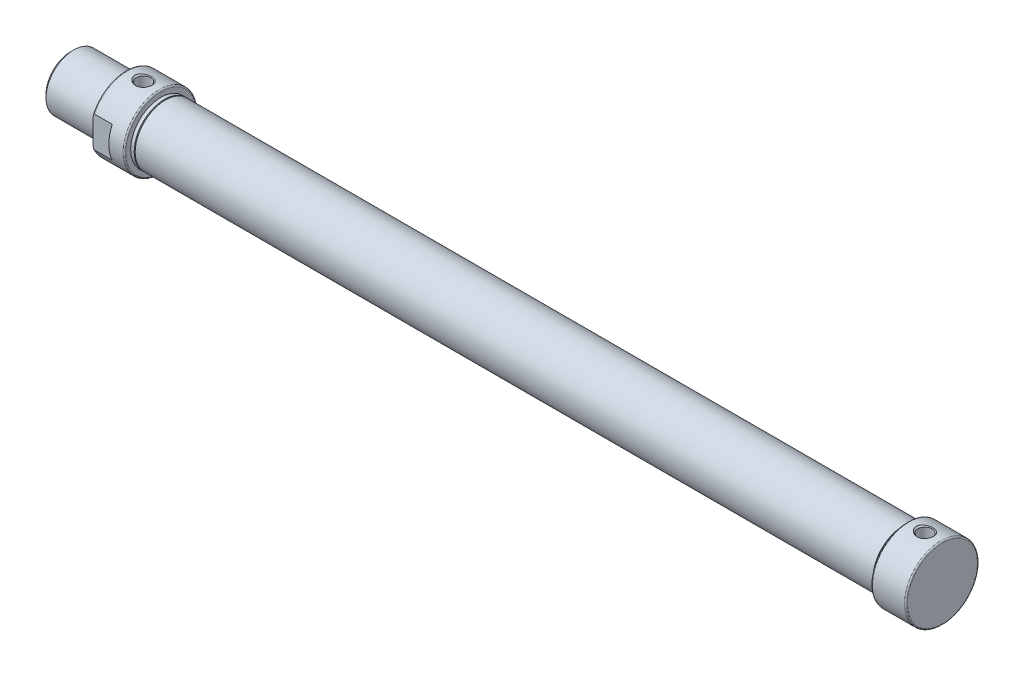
ISO-10303-21;
HEADER;
FILE_DESCRIPTION(('STEP AP214'),'2;1');
FILE_NAME('part.step','',(''),(''),'','','');
FILE_SCHEMA(('AUTOMOTIVE_DESIGN { 1 0 10303 214 1 1 1 1 }'));
ENDSEC;
DATA;
#1=APPLICATION_CONTEXT('core data for automotive mechanical design processes');
#2=APPLICATION_PROTOCOL_DEFINITION('international standard','automotive_design',2000,#1);
#3=PRODUCT_CONTEXT('',#1,'mechanical');
#4=PRODUCT('Part','Part','',(#3));
#5=PRODUCT_RELATED_PRODUCT_CATEGORY('part','',(#4));
#6=PRODUCT_DEFINITION_FORMATION('','',#4);
#7=PRODUCT_DEFINITION_CONTEXT('part definition',#1,'design');
#8=PRODUCT_DEFINITION('design','',#6,#7);
#9=PRODUCT_DEFINITION_SHAPE('','',#8);
#10=(LENGTH_UNIT() NAMED_UNIT(*) SI_UNIT(.MILLI.,.METRE.));
#11=(NAMED_UNIT(*) PLANE_ANGLE_UNIT() SI_UNIT($,.RADIAN.));
#12=(NAMED_UNIT(*) SI_UNIT($,.STERADIAN.) SOLID_ANGLE_UNIT());
#13=UNCERTAINTY_MEASURE_WITH_UNIT(LENGTH_MEASURE(1.E-05),#10,'distance_accuracy_value','');
#14=(GEOMETRIC_REPRESENTATION_CONTEXT(3) GLOBAL_UNCERTAINTY_ASSIGNED_CONTEXT((#13)) GLOBAL_UNIT_ASSIGNED_CONTEXT((#10,
#11,#12)) REPRESENTATION_CONTEXT('',''));
#15=CARTESIAN_POINT('',(0.,0.,0.));
#16=DIRECTION('',(0.,0.,1.));
#17=DIRECTION('',(1.,0.,0.));
#18=AXIS2_PLACEMENT_3D('',#15,#16,#17);
#19=CARTESIAN_POINT('',(231.,8.,0.));
#20=DIRECTION('',(-1.,0.,0.));
#21=DIRECTION('',(0.,0.,1.));
#22=AXIS2_PLACEMENT_3D('',#19,#20,#21);
#23=PLANE('',#22);
#24=CARTESIAN_POINT('',(231.,0.,0.));
#25=DIRECTION('',(-1.,0.,0.));
#26=DIRECTION('',(0.,0.,1.));
#27=AXIS2_PLACEMENT_3D('',#24,#25,#26);
#28=CIRCLE('',#27,8.);
#29=CARTESIAN_POINT('',(231.,0.,8.));
#30=VERTEX_POINT('',#29);
#31=EDGE_CURVE('E741',#30,#30,#28,.T.);
#32=ORIENTED_EDGE('',*,*,#31,.T.);
#33=EDGE_LOOP('',(#32));
#34=FACE_BOUND('',#33,.T.);
#35=ADVANCED_FACE('F17',(#34),#23,.T.);
#36=CARTESIAN_POINT('',(231.,0.,0.));
#37=DIRECTION('',(-1.,0.,0.));
#38=DIRECTION('',(0.,0.,1.));
#39=AXIS2_PLACEMENT_3D('',#36,#37,#38);
#40=CYLINDRICAL_SURFACE('',#39,8.);
#41=CARTESIAN_POINT('',(36.,0.,0.));
#42=DIRECTION('',(-1.,0.,0.));
#43=DIRECTION('',(0.,0.,1.));
#44=AXIS2_PLACEMENT_3D('',#41,#42,#43);
#45=CIRCLE('',#44,8.);
#46=CARTESIAN_POINT('',(36.,0.,8.));
#47=VERTEX_POINT('',#46);
#48=EDGE_CURVE('E743',#47,#47,#45,.F.);
#49=ORIENTED_EDGE('',*,*,#48,.F.);
#50=EDGE_LOOP('',(#49));
#51=FACE_BOUND('',#50,.T.);
#52=ORIENTED_EDGE('',*,*,#31,.F.);
#53=EDGE_LOOP('',(#52));
#54=FACE_BOUND('',#53,.T.);
#55=ADVANCED_FACE('F716',(#51,#54),#40,.F.);
#56=CARTESIAN_POINT('',(36.,3.,0.));
#57=DIRECTION('',(1.,0.,0.));
#58=DIRECTION('',(0.,0.,-1.));
#59=AXIS2_PLACEMENT_3D('',#56,#57,#58);
#60=PLANE('',#59);
#61=ORIENTED_EDGE('',*,*,#48,.T.);
#62=EDGE_LOOP('',(#61));
#63=FACE_BOUND('',#62,.T.);
#64=CARTESIAN_POINT('',(36.,0.,0.));
#65=DIRECTION('',(-1.,0.,0.));
#66=DIRECTION('',(0.,0.,1.));
#67=AXIS2_PLACEMENT_3D('',#64,#65,#66);
#68=CIRCLE('',#67,3.);
#69=CARTESIAN_POINT('',(36.,0.,3.));
#70=VERTEX_POINT('',#69);
#71=EDGE_CURVE('E746',#70,#70,#68,.T.);
#72=ORIENTED_EDGE('',*,*,#71,.T.);
#73=EDGE_LOOP('',(#72));
#74=FACE_BOUND('',#73,.T.);
#75=ADVANCED_FACE('F706',(#63,#74),#60,.T.);
#76=CARTESIAN_POINT('',(231.,0.,0.));
#77=DIRECTION('',(-1.,0.,0.));
#78=DIRECTION('',(0.,0.,1.));
#79=AXIS2_PLACEMENT_3D('',#76,#77,#78);
#80=CYLINDRICAL_SURFACE('',#79,3.);
#81=ORIENTED_EDGE('',*,*,#71,.F.);
#82=EDGE_LOOP('',(#81));
#83=FACE_BOUND('',#82,.T.);
#84=CARTESIAN_POINT('',(0.,0.,0.));
#85=DIRECTION('',(-1.,0.,0.));
#86=DIRECTION('',(0.,0.,1.));
#87=AXIS2_PLACEMENT_3D('',#84,#85,#86);
#88=CIRCLE('',#87,3.);
#89=CARTESIAN_POINT('',(0.,0.,3.));
#90=VERTEX_POINT('',#89);
#91=EDGE_CURVE('E784',#90,#90,#88,.T.);
#92=ORIENTED_EDGE('',*,*,#91,.T.);
#93=EDGE_LOOP('',(#92));
#94=FACE_BOUND('',#93,.T.);
#95=ADVANCED_FACE('F696',(#83,#94),#80,.F.);
#96=CARTESIAN_POINT('',(0.,0.,0.));
#97=DIRECTION('',(1.,0.,0.));
#98=DIRECTION('',(0.,0.,-1.));
#99=AXIS2_PLACEMENT_3D('',#96,#97,#98);
#100=PLANE('',#99);
#101=ORIENTED_EDGE('',*,*,#91,.F.);
#102=EDGE_LOOP('',(#101));
#103=FACE_BOUND('',#102,.T.);
#104=CARTESIAN_POINT('',(0.,0.,0.));
#105=DIRECTION('',(1.,0.,0.));
#106=DIRECTION('',(0.,0.,-1.));
#107=AXIS2_PLACEMENT_3D('',#104,#105,#106);
#108=CIRCLE('',#107,7.08);
#109=CARTESIAN_POINT('',(0.,0.,-7.08));
#110=VERTEX_POINT('',#109);
#111=EDGE_CURVE('E244',#110,#110,#108,.T.);
#112=ORIENTED_EDGE('',*,*,#111,.F.);
#113=EDGE_LOOP('',(#112));
#114=FACE_BOUND('',#113,.T.);
#115=ADVANCED_FACE('F686',(#103,#114),#100,.F.);
#116=CARTESIAN_POINT('',(0.919999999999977,0.,0.));
#117=DIRECTION('',(1.,0.,0.));
#118=DIRECTION('',(0.,0.,-1.));
#119=AXIS2_PLACEMENT_3D('',#116,#117,#118);
#120=CONICAL_SURFACE('',#119,8.,0.785398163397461);
#121=CARTESIAN_POINT('',(0.919999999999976,0.,0.));
#122=DIRECTION('',(-1.,0.,0.));
#123=DIRECTION('',(0.,0.,1.));
#124=AXIS2_PLACEMENT_3D('',#121,#122,#123);
#125=CIRCLE('',#124,8.);
#126=CARTESIAN_POINT('',(0.919999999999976,0.,8.));
#127=VERTEX_POINT('',#126);
#128=EDGE_CURVE('E240',#127,#127,#125,.F.);
#129=ORIENTED_EDGE('',*,*,#128,.F.);
#130=EDGE_LOOP('',(#129));
#131=FACE_BOUND('',#130,.T.);
#132=ORIENTED_EDGE('',*,*,#111,.T.);
#133=EDGE_LOOP('',(#132));
#134=FACE_BOUND('',#133,.T.);
#135=ADVANCED_FACE('F676',(#131,#134),#120,.T.);
#136=CARTESIAN_POINT('',(248.067,3.75,0.));
#137=DIRECTION('',(0.,1.,0.));
#138=DIRECTION('',(0.,0.,1.));
#139=AXIS2_PLACEMENT_3D('',#136,#137,#138);
#140=PLANE('',#139);
#141=CARTESIAN_POINT('',(246.,3.75,0.));
#142=DIRECTION('',(0.,1.,0.));
#143=DIRECTION('',(0.,0.,1.));
#144=AXIS2_PLACEMENT_3D('',#141,#142,#143);
#145=CIRCLE('',#144,2.06700000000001);
#146=CARTESIAN_POINT('',(246.,3.75,2.06700000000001));
#147=VERTEX_POINT('',#146);
#148=EDGE_CURVE('E243',#147,#147,#145,.T.);
#149=ORIENTED_EDGE('',*,*,#148,.T.);
#150=EDGE_LOOP('',(#149));
#151=FACE_BOUND('',#150,.T.);
#152=ADVANCED_FACE('F666',(#151),#140,.T.);
#153=CARTESIAN_POINT('',(23.067,3.75,0.));
#154=DIRECTION('',(0.,1.,0.));
#155=DIRECTION('',(0.,0.,1.));
#156=AXIS2_PLACEMENT_3D('',#153,#154,#155);
#157=PLANE('',#156);
#158=CARTESIAN_POINT('',(21.,3.75,0.));
#159=DIRECTION('',(0.,1.,0.));
#160=DIRECTION('',(0.,0.,1.));
#161=AXIS2_PLACEMENT_3D('',#158,#159,#160);
#162=CIRCLE('',#161,2.067);
#163=CARTESIAN_POINT('',(21.,3.75,2.067));
#164=VERTEX_POINT('',#163);
#165=EDGE_CURVE('E768',#164,#164,#162,.T.);
#166=ORIENTED_EDGE('',*,*,#165,.T.);
#167=EDGE_LOOP('',(#166));
#168=FACE_BOUND('',#167,.T.);
#169=ADVANCED_FACE('F657',(#168),#157,.T.);
#170=CARTESIAN_POINT('',(251.,0.,0.));
#171=DIRECTION('',(-1.,0.,0.));
#172=DIRECTION('',(0.,0.,1.));
#173=AXIS2_PLACEMENT_3D('',#170,#171,#172);
#174=CYLINDRICAL_SURFACE('',#173,8.);
#175=ORIENTED_EDGE('',*,*,#128,.T.);
#176=EDGE_LOOP('',(#175));
#177=FACE_BOUND('',#176,.T.);
#178=CARTESIAN_POINT('',(16.,0.,0.));
#179=DIRECTION('',(-1.,0.,0.));
#180=DIRECTION('',(0.,0.,1.));
#181=AXIS2_PLACEMENT_3D('',#178,#179,#180);
#182=CIRCLE('',#181,8.);
#183=CARTESIAN_POINT('',(16.,0.,8.));
#184=VERTEX_POINT('',#183);
#185=EDGE_CURVE('E766',#184,#184,#182,.T.);
#186=ORIENTED_EDGE('',*,*,#185,.T.);
#187=EDGE_LOOP('',(#186));
#188=FACE_BOUND('',#187,.T.);
#189=ADVANCED_FACE('F649',(#177,#188),#174,.T.);
#190=CARTESIAN_POINT('',(246.,3.75,0.));
#191=DIRECTION('',(0.,1.,0.));
#192=DIRECTION('',(0.,0.,1.));
#193=AXIS2_PLACEMENT_3D('',#190,#191,#192);
#194=CYLINDRICAL_SURFACE('',#193,2.06700000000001);
#195=CARTESIAN_POINT('',(246.,10.0669999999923,0.));
#196=DIRECTION('',(0.,1.,0.));
#197=DIRECTION('',(0.,0.,1.));
#198=AXIS2_PLACEMENT_3D('',#195,#196,#197);
#199=CIRCLE('',#198,2.06700000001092);
#200=CARTESIAN_POINT('',(246.,10.0669999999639,-2.06699999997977));
#201=VERTEX_POINT('',#200);
#202=CARTESIAN_POINT('',(246.,10.0669999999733,2.06699999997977));
#203=VERTEX_POINT('',#202);
#204=EDGE_CURVE('E234',#201,#203,#199,.T.);
#205=ORIENTED_EDGE('',*,*,#204,.T.);
#206=CARTESIAN_POINT('',(246.,10.0669999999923,0.));
#207=DIRECTION('',(0.,1.,0.));
#208=DIRECTION('',(0.,0.,1.));
#209=AXIS2_PLACEMENT_3D('',#206,#207,#208);
#210=CIRCLE('',#209,2.06700000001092);
#211=EDGE_CURVE('E224',#203,#201,#210,.T.);
#212=ORIENTED_EDGE('',*,*,#211,.T.);
#213=EDGE_LOOP('',(#205,#212));
#214=FACE_BOUND('',#213,.T.);
#215=ORIENTED_EDGE('',*,*,#148,.F.);
#216=EDGE_LOOP('',(#215));
#217=FACE_BOUND('',#216,.T.);
#218=ADVANCED_FACE('F206',(#214,#217),#194,.F.);
#219=CARTESIAN_POINT('',(251.,10.1,0.));
#220=DIRECTION('',(-1.,0.,0.));
#221=DIRECTION('',(0.,0.,1.));
#222=AXIS2_PLACEMENT_3D('',#219,#220,#221);
#223=PLANE('',#222);
#224=CARTESIAN_POINT('',(251.,0.,0.));
#225=DIRECTION('',(-1.,0.,0.));
#226=DIRECTION('',(0.,0.,-1.));
#227=AXIS2_PLACEMENT_3D('',#224,#225,#226);
#228=CIRCLE('',#227,10.1);
#229=CARTESIAN_POINT('',(251.,0.,-10.1));
#230=VERTEX_POINT('',#229);
#231=CARTESIAN_POINT('',(251.,0.,10.1));
#232=VERTEX_POINT('',#231);
#233=EDGE_CURVE('E188',#230,#232,#228,.T.);
#234=ORIENTED_EDGE('',*,*,#233,.F.);
#235=CARTESIAN_POINT('',(251.,0.,0.));
#236=DIRECTION('',(-1.,0.,0.));
#237=DIRECTION('',(0.,0.,1.));
#238=AXIS2_PLACEMENT_3D('',#235,#236,#237);
#239=CIRCLE('',#238,10.1);
#240=EDGE_CURVE('E220',#232,#230,#239,.T.);
#241=ORIENTED_EDGE('',*,*,#240,.F.);
#242=EDGE_LOOP('',(#234,#241));
#243=FACE_BOUND('',#242,.T.);
#244=ADVANCED_FACE('F195',(#243),#223,.F.);
#245=CARTESIAN_POINT('',(21.,3.75,0.));
#246=DIRECTION('',(0.,1.,0.));
#247=DIRECTION('',(0.,0.,1.));
#248=AXIS2_PLACEMENT_3D('',#245,#246,#247);
#249=CYLINDRICAL_SURFACE('',#248,2.067);
#250=CARTESIAN_POINT('',(21.,10.0670000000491,0.));
#251=DIRECTION('',(0.,1.,0.));
#252=DIRECTION('',(0.,0.,1.));
#253=AXIS2_PLACEMENT_3D('',#250,#251,#252);
#254=CIRCLE('',#253,2.06700000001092);
#255=CARTESIAN_POINT('',(21.,10.0670000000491,2.06700000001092));
#256=VERTEX_POINT('',#255);
#257=EDGE_CURVE('E136',#256,#256,#254,.T.);
#258=ORIENTED_EDGE('',*,*,#257,.T.);
#259=EDGE_LOOP('',(#258));
#260=FACE_BOUND('',#259,.T.);
#261=ORIENTED_EDGE('',*,*,#165,.F.);
#262=EDGE_LOOP('',(#261));
#263=FACE_BOUND('',#262,.T.);
#264=ADVANCED_FACE('F205',(#260,#263),#249,.F.);
#265=CARTESIAN_POINT('',(16.,8.,0.));
#266=DIRECTION('',(1.,0.,0.));
#267=DIRECTION('',(0.,0.,-1.));
#268=AXIS2_PLACEMENT_3D('',#265,#266,#267);
#269=PLANE('',#268);
#270=DIRECTION('',(0.,1.,0.));
#271=VECTOR('',#270,1.);
#272=CARTESIAN_POINT('',(16.,10.5,9.5));
#273=LINE('',#272,#271);
#274=CARTESIAN_POINT('',(16.,-3.42928563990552,9.5));
#275=VERTEX_POINT('',#274);
#276=CARTESIAN_POINT('',(16.,3.4292856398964,9.5));
#277=VERTEX_POINT('',#276);
#278=EDGE_CURVE('E331',#275,#277,#273,.T.);
#279=ORIENTED_EDGE('',*,*,#278,.T.);
#280=CARTESIAN_POINT('',(16.,0.,0.));
#281=DIRECTION('',(1.,0.,0.));
#282=DIRECTION('',(0.,0.339533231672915,-0.940594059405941));
#283=AXIS2_PLACEMENT_3D('',#280,#281,#282);
#284=CIRCLE('',#283,10.1);
#285=CARTESIAN_POINT('',(16.,3.42928563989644,-9.5));
#286=VERTEX_POINT('',#285);
#287=EDGE_CURVE('E112',#286,#277,#284,.T.);
#288=ORIENTED_EDGE('',*,*,#287,.F.);
#289=DIRECTION('',(0.,1.,0.));
#290=VECTOR('',#289,1.);
#291=CARTESIAN_POINT('',(16.,-10.5,-9.5));
#292=LINE('',#291,#290);
#293=CARTESIAN_POINT('',(16.,-3.42928563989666,-9.50000000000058));
#294=VERTEX_POINT('',#293);
#295=EDGE_CURVE('E108',#286,#294,#292,.F.);
#296=ORIENTED_EDGE('',*,*,#295,.T.);
#297=CARTESIAN_POINT('',(16.,0.,0.));
#298=DIRECTION('',(1.,0.,0.));
#299=DIRECTION('',(0.,-0.339533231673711,0.940594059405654));
#300=AXIS2_PLACEMENT_3D('',#297,#298,#299);
#301=CIRCLE('',#300,10.1000000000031);
#302=EDGE_CURVE('E327',#275,#294,#301,.T.);
#303=ORIENTED_EDGE('',*,*,#302,.F.);
#304=EDGE_LOOP('',(#279,#288,#296,#303));
#305=FACE_BOUND('',#304,.T.);
#306=ORIENTED_EDGE('',*,*,#185,.F.);
#307=EDGE_LOOP('',(#306));
#308=FACE_BOUND('',#307,.T.);
#309=ADVANCED_FACE('F305',(#305,#308),#269,.F.);
#310=CARTESIAN_POINT('',(246.,10.5027149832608,0.));
#311=DIRECTION('',(0.,1.,0.));
#312=DIRECTION('',(0.,0.,1.));
#313=AXIS2_PLACEMENT_3D('',#310,#311,#312);
#314=CONICAL_SURFACE('',#313,2.50271498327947,0.785398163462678);
#315=ORIENTED_EDGE('',*,*,#211,.F.);
#316=DIRECTION('',(0.,-0.70710678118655,-0.707106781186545));
#317=VECTOR('',#316,1.);
#318=CARTESIAN_POINT('',(246.,499000.,498991.999999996));
#319=LINE('',#318,#317);
#320=CARTESIAN_POINT('',(246.,10.2549980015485,2.25499800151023));
#321=VERTEX_POINT('',#320);
#322=EDGE_CURVE('E231',#203,#321,#319,.F.);
#323=ORIENTED_EDGE('',*,*,#322,.T.);
#324=CARTESIAN_POINT('',(246.,10.2549980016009,-2.25499800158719));
#325=CARTESIAN_POINT('',(246.075316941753,10.2549909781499,-2.25500196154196));
#326=CARTESIAN_POINT('',(246.150631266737,10.2556780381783,-2.25190468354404));
#327=CARTESIAN_POINT('',(246.300730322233,10.2583885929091,-2.23953943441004));
#328=CARTESIAN_POINT('',(246.375515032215,10.2604121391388,-2.23027122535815));
#329=CARTESIAN_POINT('',(246.524103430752,10.2657467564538,-2.20558280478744));
#330=CARTESIAN_POINT('',(246.597905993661,10.269059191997,-2.19015607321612));
#331=CARTESIAN_POINT('',(246.743888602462,10.2768647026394,-2.15323100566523));
#332=CARTESIAN_POINT('',(246.816068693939,10.2813577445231,-2.13173284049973));
#333=CARTESIAN_POINT('',(247.029198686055,10.2964031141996,-2.05830612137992));
#334=CARTESIAN_POINT('',(247.167073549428,10.3085346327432,-1.9973898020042));
#335=CARTESIAN_POINT('',(247.429853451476,10.3355159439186,-1.85269797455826));
#336=CARTESIAN_POINT('',(247.554764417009,10.350364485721,-1.76893297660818));
#337=CARTESIAN_POINT('',(247.783174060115,10.3803428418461,-1.58334774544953));
#338=CARTESIAN_POINT('',(247.887267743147,10.3954447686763,-1.48225940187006));
#339=CARTESIAN_POINT('',(248.074880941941,10.424434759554,-1.26230185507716));
#340=CARTESIAN_POINT('',(248.158411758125,10.4383234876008,-1.1434424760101));
#341=CARTESIAN_POINT('',(248.293861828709,10.4617288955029,-0.90300595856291));
#342=CARTESIAN_POINT('',(248.347998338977,10.4715320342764,-0.782709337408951));
#343=CARTESIAN_POINT('',(248.432714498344,10.4871564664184,-0.533868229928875));
#344=CARTESIAN_POINT('',(248.46331789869,10.492981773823,-0.40533220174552));
#345=CARTESIAN_POINT('',(248.497107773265,10.4994355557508,-0.159128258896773));
#346=CARTESIAN_POINT('',(248.502955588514,10.5005681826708,-0.041833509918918));
#347=CARTESIAN_POINT('',(248.494253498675,10.4988952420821,0.191953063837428));
#348=CARTESIAN_POINT('',(248.479708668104,10.4960906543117,0.308445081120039));
#349=CARTESIAN_POINT('',(248.432074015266,10.4870831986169,0.532053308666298));
#350=CARTESIAN_POINT('',(248.399822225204,10.4810341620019,0.639356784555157));
#351=CARTESIAN_POINT('',(248.318826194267,10.4662752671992,0.8473266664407));
#352=CARTESIAN_POINT('',(248.270079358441,10.4575649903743,0.947992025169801));
#353=CARTESIAN_POINT('',(248.155140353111,10.4378326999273,1.14542148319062));
#354=CARTESIAN_POINT('',(248.088195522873,10.4267166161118,1.24173633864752));
#355=CARTESIAN_POINT('',(247.940521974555,10.4035321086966,1.42298467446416));
#356=CARTESIAN_POINT('',(247.859788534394,10.3914633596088,1.50791423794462));
#357=CARTESIAN_POINT('',(247.677967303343,10.3661940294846,1.67323783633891));
#358=CARTESIAN_POINT('',(247.575640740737,10.353004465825,1.75227088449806));
#359=CARTESIAN_POINT('',(247.359972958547,10.3280409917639,1.89387211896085));
#360=CARTESIAN_POINT('',(247.246624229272,10.3162680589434,1.95642897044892));
#361=CARTESIAN_POINT('',(247.000414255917,10.2942247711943,2.06943942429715));
#362=CARTESIAN_POINT('',(246.866725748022,10.2842093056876,2.11814086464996));
#363=CARTESIAN_POINT('',(246.59321858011,10.2683091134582,2.1939336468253));
#364=CARTESIAN_POINT('',(246.453406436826,10.2624201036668,2.22104739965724));
#365=CARTESIAN_POINT('',(246.26054000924,10.2576018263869,2.2431284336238));
#366=CARTESIAN_POINT('',(246.208486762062,10.2566261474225,2.24758269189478));
#367=CARTESIAN_POINT('',(246.104295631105,10.2553247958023,2.25351367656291));
#368=CARTESIAN_POINT('',(246.052158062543,10.2549979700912,2.25499568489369));
#369=CARTESIAN_POINT('',(246.,10.2549980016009,2.25499800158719));
#370=B_SPLINE_CURVE_WITH_KNOTS('',3,(#324,#325,#326,#327,#328,#329,#330,#331,#332,#333,#334,
#335,#336,#337,#338,#339,#340,#341,#342,#343,#344,#345,#346,#347,#348,#349,#350,#351,#352,#353,
#354,#355,#356,#357,#358,#359,#360,#361,#362,#363,#364,#365,#366,#367,#368,#369),.UNSPECIFIED.,
.F.,.F.,(4,2,2,2,2,2,2,2,2,2,2,2,2,2,2,2,2,2,2,2,2,2,4),(0.,0.225879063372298,0.45176683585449,
0.677894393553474,0.904015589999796,1.35525084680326,1.80627888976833,2.2415710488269,
2.6766234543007,3.07122035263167,3.46541847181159,3.81595371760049,4.16640175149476,
4.50153803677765,4.83672706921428,5.18873588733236,5.54086549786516,5.92914938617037,
6.31769970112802,6.74377168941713,7.16940077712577,7.32609058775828,7.48250170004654),.UNSPECIFIED.);
#371=CARTESIAN_POINT('',(246.,10.2549980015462,-2.25499800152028));
#372=VERTEX_POINT('',#371);
#373=EDGE_CURVE('E292',#372,#321,#370,.T.);
#374=ORIENTED_EDGE('',*,*,#373,.F.);
#375=DIRECTION('',(0.,-0.70710678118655,0.707106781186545));
#376=VECTOR('',#375,1.);
#377=CARTESIAN_POINT('',(246.000000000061,499000.,-498991.999999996));
#378=LINE('',#377,#376);
#379=EDGE_CURVE('E237',#372,#201,#378,.T.);
#380=ORIENTED_EDGE('',*,*,#379,.T.);
#381=EDGE_LOOP('',(#315,#323,#374,#380));
#382=FACE_BOUND('',#381,.T.);
#383=ADVANCED_FACE('F301',(#382),#314,.F.);
#384=CARTESIAN_POINT('',(246.,10.5026219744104,0.));
#385=DIRECTION('',(0.,1.,0.));
#386=DIRECTION('',(0.,0.,1.));
#387=AXIS2_PLACEMENT_3D('',#384,#385,#386);
#388=CONICAL_SURFACE('',#387,2.50262197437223,0.785398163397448);
#389=ORIENTED_EDGE('',*,*,#379,.F.);
#390=CARTESIAN_POINT('',(246.,10.2549980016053,2.25499800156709));
#391=CARTESIAN_POINT('',(245.924683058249,10.2549909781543,2.25500196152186));
#392=CARTESIAN_POINT('',(245.849368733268,10.2556780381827,2.25190468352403));
#393=CARTESIAN_POINT('',(245.699269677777,10.2583885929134,2.23953943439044));
#394=CARTESIAN_POINT('',(245.624484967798,10.260412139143,2.23027122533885));
#395=CARTESIAN_POINT('',(245.475896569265,10.2657467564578,2.20558280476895));
#396=CARTESIAN_POINT('',(245.402094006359,10.2690591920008,2.19015607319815));
#397=CARTESIAN_POINT('',(245.256111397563,10.2768647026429,2.15323100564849));
#398=CARTESIAN_POINT('',(245.183931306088,10.2813577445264,2.13173284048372));
#399=CARTESIAN_POINT('',(244.970801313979,10.2964031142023,2.05830612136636));
#400=CARTESIAN_POINT('',(244.832926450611,10.3085346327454,1.9973898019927));
#401=CARTESIAN_POINT('',(244.570146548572,10.3355159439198,1.85269797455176));
#402=CARTESIAN_POINT('',(244.445235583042,10.3503644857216,1.76893297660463));
#403=CARTESIAN_POINT('',(244.216825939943,10.3803428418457,1.58334774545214));
#404=CARTESIAN_POINT('',(244.112732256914,10.3954447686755,1.48225940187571));
#405=CARTESIAN_POINT('',(243.925119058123,10.4244347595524,1.26230185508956));
#406=CARTESIAN_POINT('',(243.841588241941,10.438323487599,1.14344247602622));
#407=CARTESIAN_POINT('',(243.706138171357,10.461728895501,0.90300595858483));
#408=CARTESIAN_POINT('',(243.652001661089,10.4715320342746,0.782709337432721));
#409=CARTESIAN_POINT('',(243.567285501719,10.487156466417,0.533868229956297));
#410=CARTESIAN_POINT('',(243.536682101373,10.4929817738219,0.405332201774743));
#411=CARTESIAN_POINT('',(243.502892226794,10.4994355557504,0.159128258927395));
#412=CARTESIAN_POINT('',(243.497044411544,10.5005681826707,0.041833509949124));
#413=CARTESIAN_POINT('',(243.505746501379,10.4988952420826,-0.191953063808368));
#414=CARTESIAN_POINT('',(243.520291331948,10.4960906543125,-0.308445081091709));
#415=CARTESIAN_POINT('',(243.567925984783,10.4870831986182,-0.532053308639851));
#416=CARTESIAN_POINT('',(243.600177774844,10.4810341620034,-0.639356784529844));
#417=CARTESIAN_POINT('',(243.681173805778,10.4662752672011,-0.847326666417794));
#418=CARTESIAN_POINT('',(243.729920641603,10.4575649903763,-0.947992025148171));
#419=CARTESIAN_POINT('',(243.84485964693,10.4378326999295,-1.14542148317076));
#420=CARTESIAN_POINT('',(243.911804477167,10.4267166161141,-1.24173633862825));
#421=CARTESIAN_POINT('',(244.059478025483,10.4035321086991,-1.42298467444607));
#422=CARTESIAN_POINT('',(244.140211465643,10.3914633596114,-1.50791423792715));
#423=CARTESIAN_POINT('',(244.322032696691,10.3661940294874,-1.67323783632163));
#424=CARTESIAN_POINT('',(244.424359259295,10.353004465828,-1.75227088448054));
#425=CARTESIAN_POINT('',(244.640027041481,10.3280409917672,-1.89387211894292));
#426=CARTESIAN_POINT('',(244.753375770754,10.3162680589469,-1.95642897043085));
#427=CARTESIAN_POINT('',(244.999585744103,10.2942247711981,-2.06943942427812));
#428=CARTESIAN_POINT('',(245.133274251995,10.2842093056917,-2.11814086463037));
#429=CARTESIAN_POINT('',(245.4067814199,10.2683091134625,-2.19393364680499));
#430=CARTESIAN_POINT('',(245.54659356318,10.2624201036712,-2.22104739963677));
#431=CARTESIAN_POINT('',(245.739459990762,10.2576018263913,-2.24312843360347));
#432=CARTESIAN_POINT('',(245.791513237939,10.2566261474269,-2.24758269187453));
#433=CARTESIAN_POINT('',(245.895704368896,10.2553247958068,-2.25351367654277));
#434=CARTESIAN_POINT('',(245.947841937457,10.2549979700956,-2.25499568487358));
#435=CARTESIAN_POINT('',(246.,10.2549980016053,-2.25499800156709));
#436=B_SPLINE_CURVE_WITH_KNOTS('',3,(#390,#391,#392,#393,#394,#395,#396,#397,#398,#399,#400,
#401,#402,#403,#404,#405,#406,#407,#408,#409,#410,#411,#412,#413,#414,#415,#416,#417,#418,#419,
#420,#421,#422,#423,#424,#425,#426,#427,#428,#429,#430,#431,#432,#433,#434,#435),.UNSPECIFIED.,
.F.,.F.,(4,2,2,2,2,2,2,2,2,2,2,2,2,2,2,2,2,2,2,2,2,2,4),(0.,0.225879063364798,0.451766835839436,
0.677894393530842,0.904015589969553,1.35525084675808,1.8062788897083,2.24157104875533,
2.67662345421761,3.07122035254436,3.46541847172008,3.8159537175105,4.16640175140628,
4.50153803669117,4.83672706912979,5.18873588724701,5.54086549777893,5.92914938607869,
6.31769970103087,6.74377168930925,7.16940077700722,7.32609058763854,7.48250169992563),.UNSPECIFIED.);
#437=EDGE_CURVE('E272',#321,#372,#436,.T.);
#438=ORIENTED_EDGE('',*,*,#437,.F.);
#439=ORIENTED_EDGE('',*,*,#322,.F.);
#440=ORIENTED_EDGE('',*,*,#204,.F.);
#441=EDGE_LOOP('',(#389,#438,#439,#440));
#442=FACE_BOUND('',#441,.T.);
#443=ADVANCED_FACE('F304',(#442),#388,.F.);
#444=CARTESIAN_POINT('',(250.6,0.,0.));
#445=DIRECTION('',(-1.,0.,0.));
#446=DIRECTION('',(0.,0.,1.));
#447=AXIS2_PLACEMENT_3D('',#444,#445,#446);
#448=TOROIDAL_SURFACE('',#447,10.1,0.399999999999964);
#449=CARTESIAN_POINT('',(250.6,0.,0.));
#450=DIRECTION('',(-1.,0.,0.));
#451=DIRECTION('',(0.,0.,1.));
#452=AXIS2_PLACEMENT_3D('',#449,#450,#451);
#453=CIRCLE('',#452,10.5);
#454=CARTESIAN_POINT('',(250.6,0.,10.5));
#455=VERTEX_POINT('',#454);
#456=EDGE_CURVE('E828',#455,#455,#453,.T.);
#457=ORIENTED_EDGE('',*,*,#456,.F.);
#458=EDGE_LOOP('',(#457));
#459=FACE_BOUND('',#458,.T.);
#460=ORIENTED_EDGE('',*,*,#240,.T.);
#461=ORIENTED_EDGE('',*,*,#233,.T.);
#462=EDGE_LOOP('',(#460,#461));
#463=FACE_BOUND('',#462,.T.);
#464=ADVANCED_FACE('F156',(#459,#463),#448,.T.);
#465=CARTESIAN_POINT('',(16.4,0.,0.));
#466=DIRECTION('',(-1.,0.,0.));
#467=DIRECTION('',(0.,0.,1.));
#468=AXIS2_PLACEMENT_3D('',#465,#466,#467);
#469=TOROIDAL_SURFACE('',#468,10.1,0.400000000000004);
#470=ORIENTED_EDGE('',*,*,#302,.T.);
#471=CARTESIAN_POINT('',(16.,-3.42928563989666,-9.5));
#472=CARTESIAN_POINT('',(16.0000332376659,-3.48288224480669,-9.50000000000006));
#473=CARTESIAN_POINT('',(16.0012461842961,-3.53650979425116,-9.50000000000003));
#474=CARTESIAN_POINT('',(16.0065645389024,-3.64386324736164,-9.49999999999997));
#475=CARTESIAN_POINT('',(16.0106831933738,-3.6975884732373,-9.49999999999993));
#476=CARTESIAN_POINT('',(16.0223160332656,-3.80431725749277,-9.50000000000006));
#477=CARTESIAN_POINT('',(16.0298071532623,-3.85732323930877,-9.50000000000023));
#478=CARTESIAN_POINT('',(16.0490200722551,-3.96249904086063,-9.49999999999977));
#479=CARTESIAN_POINT('',(16.0607331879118,-4.01467034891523,-9.49999999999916));
#480=CARTESIAN_POINT('',(16.0827641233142,-4.09248292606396,-9.49999999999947));
#481=CARTESIAN_POINT('',(16.0909992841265,-4.11870921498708,-9.49999999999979));
#482=CARTESIAN_POINT('',(16.1093451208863,-4.17067258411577,-9.50000000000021));
#483=CARTESIAN_POINT('',(16.119466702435,-4.1964058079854,-9.50000000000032));
#484=CARTESIAN_POINT('',(16.1457414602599,-4.25534717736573,-9.49999999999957));
#485=CARTESIAN_POINT('',(16.1627805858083,-4.28818822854,-9.49999999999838));
#486=CARTESIAN_POINT('',(16.1925096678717,-4.3346494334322,-9.5000000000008));
#487=CARTESIAN_POINT('',(16.2030655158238,-4.34961706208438,-9.5000000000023));
#488=CARTESIAN_POINT('',(16.2258463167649,-4.37820358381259,-9.4999999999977));
#489=CARTESIAN_POINT('',(16.2380701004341,-4.39182341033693,-9.49999999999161));
#490=CARTESIAN_POINT('',(16.2694317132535,-4.42165756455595,-9.49999999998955));
#491=CARTESIAN_POINT('',(16.2894688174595,-4.43701974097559,-9.49999999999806));
#492=CARTESIAN_POINT('',(16.3226309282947,-4.45476883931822,-9.50000000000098));
#493=CARTESIAN_POINT('',(16.3343136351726,-4.4598221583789,-9.50000000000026));
#494=CARTESIAN_POINT('',(16.3584399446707,-4.46748212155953,-9.49999999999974));
#495=CARTESIAN_POINT('',(16.3708800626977,-4.47009918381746,-9.49999999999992));
#496=CARTESIAN_POINT('',(16.388944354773,-4.47187043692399,-9.50000000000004));
#497=CARTESIAN_POINT('',(16.3944727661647,-4.47214397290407,-9.50000000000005));
#498=CARTESIAN_POINT('',(16.4,-4.47213595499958,-9.5));
#499=B_SPLINE_CURVE_WITH_KNOTS('',3,(#471,#472,#473,#474,#475,#476,#477,#478,#479,#480,#481,
#482,#483,#484,#485,#486,#487,#488,#489,#490,#491,#492,#493,#494,#495,#496,#497,#498),
.UNSPECIFIED.,.F.,.F.,(4,2,2,2,2,2,2,2,2,2,2,2,2,4),(0.,0.160825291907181,0.322388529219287,
0.482863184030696,0.643009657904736,0.725418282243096,0.808318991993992,0.918848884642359,
0.973689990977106,1.02849284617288,1.10318375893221,1.14116883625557,1.17899072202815,
1.19557156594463),.UNSPECIFIED.);
#500=CARTESIAN_POINT('',(16.4,-4.47213595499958,-9.5));
#501=VERTEX_POINT('',#500);
#502=EDGE_CURVE('E135',#294,#501,#499,.T.);
#503=ORIENTED_EDGE('',*,*,#502,.T.);
#504=CARTESIAN_POINT('',(16.4,0.,0.));
#505=DIRECTION('',(-1.,0.,0.));
#506=DIRECTION('',(0.,0.,1.));
#507=AXIS2_PLACEMENT_3D('',#504,#505,#506);
#508=CIRCLE('',#507,10.5);
#509=CARTESIAN_POINT('',(16.4,-4.47213595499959,9.5));
#510=VERTEX_POINT('',#509);
#511=EDGE_CURVE('E143',#510,#501,#508,.F.);
#512=ORIENTED_EDGE('',*,*,#511,.F.);
#513=CARTESIAN_POINT('',(16.4,-4.47213595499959,9.5));
#514=CARTESIAN_POINT('',(16.3894858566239,-4.47216378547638,9.5));
#515=CARTESIAN_POINT('',(16.3790080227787,-4.47116407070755,9.5));
#516=CARTESIAN_POINT('',(16.3585005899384,-4.46736714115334,9.5));
#517=CARTESIAN_POINT('',(16.3484672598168,-4.4645904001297,9.5));
#518=CARTESIAN_POINT('',(16.3266652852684,-4.45664513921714,9.5));
#519=CARTESIAN_POINT('',(16.3150488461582,-4.45106576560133,9.5));
#520=CARTESIAN_POINT('',(16.2928339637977,-4.43810179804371,9.5));
#521=CARTESIAN_POINT('',(16.2822405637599,-4.43070883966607,9.5));
#522=CARTESIAN_POINT('',(16.2561343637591,-4.40985262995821,9.49999999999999));
#523=CARTESIAN_POINT('',(16.2414291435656,-4.3953892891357,9.5));
#524=CARTESIAN_POINT('',(16.2142978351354,-4.36449939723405,9.5));
#525=CARTESIAN_POINT('',(16.2018761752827,-4.34806913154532,9.5));
#526=CARTESIAN_POINT('',(16.1789772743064,-4.31410030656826,9.5));
#527=CARTESIAN_POINT('',(16.1684863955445,-4.2965707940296,9.5));
#528=CARTESIAN_POINT('',(16.1490003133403,-4.26069020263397,9.5));
#529=CARTESIAN_POINT('',(16.1400066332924,-4.24233831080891,9.5));
#530=CARTESIAN_POINT('',(16.1232185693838,-4.20495095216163,9.5));
#531=CARTESIAN_POINT('',(16.1154326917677,-4.18591170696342,9.5));
#532=CARTESIAN_POINT('',(16.1009466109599,-4.14744025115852,9.5));
#533=CARTESIAN_POINT('',(16.0942458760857,-4.12800823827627,9.5));
#534=CARTESIAN_POINT('',(16.0761441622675,-4.07118130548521,9.49999999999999));
#535=CARTESIAN_POINT('',(16.0659574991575,-4.03339887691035,9.5));
#536=CARTESIAN_POINT('',(16.0482133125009,-3.95717407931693,9.5));
#537=CARTESIAN_POINT('',(16.0406605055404,-3.91873065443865,9.5));
#538=CARTESIAN_POINT('',(16.0277264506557,-3.84140900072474,9.5));
#539=CARTESIAN_POINT('',(16.0223494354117,-3.80253007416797,9.5));
#540=CARTESIAN_POINT('',(16.0136706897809,-3.72643416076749,9.5));
#541=CARTESIAN_POINT('',(16.0102818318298,-3.6892268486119,9.5));
#542=CARTESIAN_POINT('',(16.0049884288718,-3.61480389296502,9.5));
#543=CARTESIAN_POINT('',(16.0030801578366,-3.57758850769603,9.5));
#544=CARTESIAN_POINT('',(16.0005932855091,-3.50334192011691,9.5));
#545=CARTESIAN_POINT('',(16.0000065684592,-3.46631099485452,9.5));
#546=CARTESIAN_POINT('',(16.,-3.42928563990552,9.5));
#547=B_SPLINE_CURVE_WITH_KNOTS('',3,(#513,#514,#515,#516,#517,#518,#519,#520,#521,#522,#523,
#524,#525,#526,#527,#528,#529,#530,#531,#532,#533,#534,#535,#536,#537,#538,#539,#540,#541,#542,
#543,#544,#545,#546),.UNSPECIFIED.,.F.,.F.,(4,2,2,2,2,2,2,2,2,2,2,2,2,2,2,2,4),(0.,
0.0314363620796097,0.0625168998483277,0.100962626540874,0.139589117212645,0.201119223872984,
0.262767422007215,0.323961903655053,0.385218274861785,0.446888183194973,0.508527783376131,
0.625784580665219,0.743250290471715,0.860943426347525,0.972994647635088,1.08476295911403,
1.19584300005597),.UNSPECIFIED.);
#548=EDGE_CURVE('E111',#510,#275,#547,.T.);
#549=ORIENTED_EDGE('',*,*,#548,.T.);
#550=EDGE_LOOP('',(#470,#503,#512,#549));
#551=FACE_BOUND('',#550,.T.);
#552=ADVANCED_FACE('F151',(#551),#469,.T.);
#553=CARTESIAN_POINT('',(21.,10.5026219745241,0.));
#554=DIRECTION('',(0.,1.,0.));
#555=DIRECTION('',(0.,0.,1.));
#556=AXIS2_PLACEMENT_3D('',#553,#554,#555);
#557=CONICAL_SURFACE('',#556,2.50262197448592,0.785398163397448);
#558=CARTESIAN_POINT('',(21.,10.2549980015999,2.25499800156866));
#559=CARTESIAN_POINT('',(20.8495599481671,10.2550019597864,2.25499283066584));
#560=CARTESIAN_POINT('',(20.6989268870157,10.2577441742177,2.24261957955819));
#561=CARTESIAN_POINT('',(20.4016972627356,10.2684060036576,2.19327478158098));
#562=CARTESIAN_POINT('',(20.2551099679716,10.2763366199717,2.15625096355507));
#563=CARTESIAN_POINT('',(19.9707244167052,10.2964049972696,2.05828369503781));
#564=CARTESIAN_POINT('',(19.8329100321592,10.3085347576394,1.9973857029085));
#565=CARTESIAN_POINT('',(19.5701721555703,10.3355148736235,1.85270713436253));
#566=CARTESIAN_POINT('',(19.4452432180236,10.350364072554,1.76893627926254));
#567=CARTESIAN_POINT('',(19.2168156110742,10.3803436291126,1.58334215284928));
#568=CARTESIAN_POINT('',(19.1127216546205,10.3954461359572,1.48225007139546));
#569=CARTESIAN_POINT('',(18.9251131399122,10.424435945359,1.26229182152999));
#570=CARTESIAN_POINT('',(18.8415854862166,10.4383240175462,1.14343704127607));
#571=CARTESIAN_POINT('',(18.7061390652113,10.4617286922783,0.903008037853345));
#572=CARTESIAN_POINT('',(18.6520036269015,10.4715316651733,0.782713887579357));
#573=CARTESIAN_POINT('',(18.5672867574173,10.4871562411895,0.533873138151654));
#574=CARTESIAN_POINT('',(18.536682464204,10.4929817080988,0.4053346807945));
#575=CARTESIAN_POINT('',(18.5028921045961,10.4994355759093,0.159127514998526));
#576=CARTESIAN_POINT('',(18.4970443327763,10.5005681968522,0.0418320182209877));
#577=CARTESIAN_POINT('',(18.5057466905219,10.4988952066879,-0.191954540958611));
#578=CARTESIAN_POINT('',(18.5202914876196,10.4960906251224,-0.3084458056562));
#579=CARTESIAN_POINT('',(18.5679258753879,10.4870832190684,-0.532052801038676));
#580=CARTESIAN_POINT('',(18.6001774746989,10.4810342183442,-0.639355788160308));
#581=CARTESIAN_POINT('',(18.681173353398,10.46627534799,-0.847325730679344));
#582=CARTESIAN_POINT('',(18.7299203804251,10.4575650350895,-0.947991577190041));
#583=CARTESIAN_POINT('',(18.8448606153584,10.4378325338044,-1.14542314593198));
#584=CARTESIAN_POINT('',(18.9118066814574,10.4267162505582,-1.24173950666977));
#585=CARTESIAN_POINT('',(19.0594806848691,10.4035317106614,-1.4229874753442));
#586=CARTESIAN_POINT('',(19.1402128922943,10.3914631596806,-1.5079155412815));
#587=CARTESIAN_POINT('',(19.3220255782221,10.3661950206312,-1.67323135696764));
#588=CARTESIAN_POINT('',(19.4243439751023,10.3530064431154,-1.75225905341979));
#589=CARTESIAN_POINT('',(19.6400100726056,10.3280427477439,-1.89386277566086));
#590=CARTESIAN_POINT('',(19.7533669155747,10.3162688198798,-1.95642500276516));
#591=CARTESIAN_POINT('',(19.9996258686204,10.2942212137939,-2.06945773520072));
#592=CARTESIAN_POINT('',(20.1333577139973,10.2842031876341,-2.11817087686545));
#593=CARTESIAN_POINT('',(20.4068685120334,10.2683053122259,-2.19395091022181));
#594=CARTESIAN_POINT('',(20.5466370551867,10.2624186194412,-2.22105360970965));
#595=CARTESIAN_POINT('',(20.7394138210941,10.2576031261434,-2.24312269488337));
#596=CARTESIAN_POINT('',(20.7914207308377,10.2566282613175,-2.24757359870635));
#597=CARTESIAN_POINT('',(20.8956106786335,10.2553250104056,-2.25351215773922));
#598=CARTESIAN_POINT('',(20.9477937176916,10.2549966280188,-2.254999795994));
#599=CARTESIAN_POINT('',(21.1504400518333,10.255001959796,-2.25499283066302));
#600=CARTESIAN_POINT('',(21.3010731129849,10.2577441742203,-2.24261957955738));
#601=CARTESIAN_POINT('',(21.5983027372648,10.268406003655,-2.19327478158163));
#602=CARTESIAN_POINT('',(21.7448900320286,10.276336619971,-2.15625096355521));
#603=CARTESIAN_POINT('',(22.0292755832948,10.2964049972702,-2.05828369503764));
#604=CARTESIAN_POINT('',(22.1670899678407,10.3085347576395,-1.99738570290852));
#605=CARTESIAN_POINT('',(22.4298278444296,10.3355148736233,-1.85270713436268));
#606=CARTESIAN_POINT('',(22.5547567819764,10.3503640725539,-1.76893627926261));
#607=CARTESIAN_POINT('',(22.7831843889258,10.3803436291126,-1.58334215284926));
#608=CARTESIAN_POINT('',(22.8872783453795,10.3954461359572,-1.48225007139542));
#609=CARTESIAN_POINT('',(23.0748868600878,10.424435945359,-1.26229182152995));
#610=CARTESIAN_POINT('',(23.1584145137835,10.4383240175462,-1.14343704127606));
#611=CARTESIAN_POINT('',(23.2938609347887,10.4617286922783,-0.903008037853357));
#612=CARTESIAN_POINT('',(23.3479963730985,10.4715316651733,-0.782713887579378));
#613=CARTESIAN_POINT('',(23.4327132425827,10.4871562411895,-0.533873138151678));
#614=CARTESIAN_POINT('',(23.463317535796,10.4929817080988,-0.405334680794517));
#615=CARTESIAN_POINT('',(23.4971078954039,10.4994355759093,-0.159127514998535));
#616=CARTESIAN_POINT('',(23.5029556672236,10.5005681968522,-0.0418320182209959));
#617=CARTESIAN_POINT('',(23.4942533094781,10.4988952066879,0.191954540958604));
#618=CARTESIAN_POINT('',(23.4797085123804,10.4960906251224,0.308445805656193));
#619=CARTESIAN_POINT('',(23.4320741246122,10.4870832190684,0.532052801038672));
#620=CARTESIAN_POINT('',(23.3998225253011,10.4810342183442,0.639355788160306));
#621=CARTESIAN_POINT('',(23.318826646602,10.46627534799,0.847325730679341));
#622=CARTESIAN_POINT('',(23.2700796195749,10.4575650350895,0.947991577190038));
#623=CARTESIAN_POINT('',(23.1551393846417,10.4378325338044,1.14542314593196));
#624=CARTESIAN_POINT('',(23.0881933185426,10.4267162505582,1.24173950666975));
#625=CARTESIAN_POINT('',(22.9405193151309,10.4035317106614,1.42298747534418));
#626=CARTESIAN_POINT('',(22.8597871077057,10.3914631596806,1.50791554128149));
#627=CARTESIAN_POINT('',(22.6779744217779,10.3661950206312,1.67323135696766));
#628=CARTESIAN_POINT('',(22.5756560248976,10.3530064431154,1.75225905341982));
#629=CARTESIAN_POINT('',(22.3599899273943,10.3280427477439,1.8938627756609));
#630=CARTESIAN_POINT('',(22.2466330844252,10.3162688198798,1.9564250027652));
#631=CARTESIAN_POINT('',(22.0003741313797,10.294221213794,2.06945773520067));
#632=CARTESIAN_POINT('',(21.8666422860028,10.2842031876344,2.11817087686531));
#633=CARTESIAN_POINT('',(21.5931314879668,10.2683053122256,2.19395091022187));
#634=CARTESIAN_POINT('',(21.4533629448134,10.2624186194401,2.22105360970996));
#635=CARTESIAN_POINT('',(21.2605861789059,10.2576031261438,2.24312269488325));
#636=CARTESIAN_POINT('',(21.2085792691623,10.2566282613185,2.24757359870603));
#637=CARTESIAN_POINT('',(21.1043893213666,10.2553250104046,2.25351215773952));
#638=CARTESIAN_POINT('',(21.0522062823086,10.2549966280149,2.25499979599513));
#639=CARTESIAN_POINT('',(21.,10.2549980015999,2.25499800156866));
#640=B_SPLINE_CURVE_WITH_KNOTS('',3,(#558,#559,#560,#561,#562,#563,#564,#565,#566,#567,#568,
#569,#570,#571,#572,#573,#574,#575,#576,#577,#578,#579,#580,#581,#582,#583,#584,#585,#586,#587,
#588,#589,#590,#591,#592,#593,#594,#595,#596,#597,#598,#599,#600,#601,#602,#603,#604,#605,#606,
#607,#608,#609,#610,#611,#612,#613,#614,#615,#616,#617,#618,#619,#620,#621,#622,#623,#624,#625,
#626,#627,#628,#629,#630,#631,#632,#633,#634,#635,#636,#637,#638,#639),.UNSPECIFIED.,.T.,.F.,(4,
2,2,2,2,2,2,2,2,2,2,2,2,2,2,2,2,2,2,2,2,2,2,2,2,2,2,2,2,2,2,2,2,2,2,2,2,2,2,2,4),(0.,
0.451124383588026,0.903208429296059,1.35443581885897,1.80547172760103,2.24078296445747,
2.67581629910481,3.07040573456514,3.46461131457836,3.81514877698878,4.16559459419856,
4.50072932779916,4.83591991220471,5.18793451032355,5.54005833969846,5.92831327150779,
6.31689254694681,6.74309692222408,7.16859361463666,7.32514362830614,7.48169453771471,
7.93281892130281,8.38490296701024,8.83613035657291,9.28716626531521,9.72247750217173,
10.157510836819,10.5521002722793,10.9463058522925,11.296843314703,11.6472891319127,
11.9824238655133,12.3176144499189,12.6696290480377,13.0217528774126,13.4100078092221,
13.798587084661,14.224791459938,14.6502881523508,14.8068381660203,14.9633890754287),.UNSPECIFIED.);
#641=CARTESIAN_POINT('',(21.,10.2549980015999,2.25499800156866));
#642=VERTEX_POINT('',#641);
#643=EDGE_CURVE('E129',#642,#642,#640,.T.);
#644=ORIENTED_EDGE('',*,*,#643,.F.);
#645=EDGE_LOOP('',(#644));
#646=FACE_BOUND('',#645,.T.);
#647=ORIENTED_EDGE('',*,*,#257,.F.);
#648=EDGE_LOOP('',(#647));
#649=FACE_BOUND('',#648,.T.);
#650=ADVANCED_FACE('F155',(#646,#649),#557,.F.);
#651=CARTESIAN_POINT('',(21.5,0.,0.));
#652=DIRECTION('',(1.,0.,0.));
#653=DIRECTION('',(0.,0.,-1.));
#654=AXIS2_PLACEMENT_3D('',#651,#652,#653);
#655=PLANE('',#654);
#656=CARTESIAN_POINT('',(21.5,0.,0.));
#657=DIRECTION('',(-1.,0.,0.));
#658=DIRECTION('',(0.,0.,1.));
#659=AXIS2_PLACEMENT_3D('',#656,#657,#658);
#660=CIRCLE('',#659,10.5);
#661=CARTESIAN_POINT('',(21.5,-4.47213595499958,-9.5));
#662=VERTEX_POINT('',#661);
#663=CARTESIAN_POINT('',(21.5,4.47213595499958,-9.5));
#664=VERTEX_POINT('',#663);
#665=EDGE_CURVE('E127',#662,#664,#660,.F.);
#666=ORIENTED_EDGE('',*,*,#665,.F.);
#667=DIRECTION('',(0.,1.,0.));
#668=VECTOR('',#667,1.);
#669=CARTESIAN_POINT('',(21.5,-10.5,-9.5));
#670=LINE('',#669,#668);
#671=EDGE_CURVE('E139',#662,#664,#670,.T.);
#672=ORIENTED_EDGE('',*,*,#671,.T.);
#673=EDGE_LOOP('',(#666,#672));
#674=FACE_BOUND('',#673,.T.);
#675=ADVANCED_FACE('F576',(#674),#655,.F.);
#676=CARTESIAN_POINT('',(21.5,-10.5,-9.5));
#677=DIRECTION('',(0.,0.,1.));
#678=DIRECTION('',(1.,0.,0.));
#679=AXIS2_PLACEMENT_3D('',#676,#677,#678);
#680=PLANE('',#679);
#681=ORIENTED_EDGE('',*,*,#671,.F.);
#682=DIRECTION('',(-1.,0.,0.));
#683=VECTOR('',#682,1.);
#684=CARTESIAN_POINT('',(251.,-4.47213595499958,-9.5));
#685=LINE('',#684,#683);
#686=EDGE_CURVE('E141',#501,#662,#685,.F.);
#687=ORIENTED_EDGE('',*,*,#686,.F.);
#688=ORIENTED_EDGE('',*,*,#502,.F.);
#689=ORIENTED_EDGE('',*,*,#295,.F.);
#690=CARTESIAN_POINT('',(16.4,4.47213595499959,-9.5));
#691=CARTESIAN_POINT('',(16.3894858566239,4.47216378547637,-9.5));
#692=CARTESIAN_POINT('',(16.3790080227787,4.47116407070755,-9.5));
#693=CARTESIAN_POINT('',(16.3585005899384,4.46736714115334,-9.5));
#694=CARTESIAN_POINT('',(16.3484672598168,4.46459040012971,-9.5));
#695=CARTESIAN_POINT('',(16.3266652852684,4.45664513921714,-9.5));
#696=CARTESIAN_POINT('',(16.3150488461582,4.45106576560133,-9.5));
#697=CARTESIAN_POINT('',(16.2928339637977,4.43810179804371,-9.5));
#698=CARTESIAN_POINT('',(16.2822405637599,4.43070883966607,-9.5));
#699=CARTESIAN_POINT('',(16.2561343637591,4.40985262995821,-9.5));
#700=CARTESIAN_POINT('',(16.2414291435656,4.3953892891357,-9.5));
#701=CARTESIAN_POINT('',(16.2142978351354,4.36449939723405,-9.5));
#702=CARTESIAN_POINT('',(16.2018761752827,4.34806913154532,-9.50000000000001));
#703=CARTESIAN_POINT('',(16.1789772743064,4.31410030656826,-9.50000000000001));
#704=CARTESIAN_POINT('',(16.1684863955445,4.29657079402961,-9.5));
#705=CARTESIAN_POINT('',(16.1490003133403,4.26069020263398,-9.5));
#706=CARTESIAN_POINT('',(16.1400066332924,4.24233831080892,-9.5));
#707=CARTESIAN_POINT('',(16.1232185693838,4.20495095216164,-9.5));
#708=CARTESIAN_POINT('',(16.1154326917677,4.18591170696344,-9.5));
#709=CARTESIAN_POINT('',(16.1009466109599,4.14744025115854,-9.5));
#710=CARTESIAN_POINT('',(16.0942458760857,4.12800823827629,-9.5));
#711=CARTESIAN_POINT('',(16.0761441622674,4.07118130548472,-9.49999999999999));
#712=CARTESIAN_POINT('',(16.0659574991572,4.03339887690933,-9.5));
#713=CARTESIAN_POINT('',(16.0482133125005,3.95717407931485,-9.5));
#714=CARTESIAN_POINT('',(16.0406605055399,3.91873065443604,-9.5));
#715=CARTESIAN_POINT('',(16.0277264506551,3.84140900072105,-9.5));
#716=CARTESIAN_POINT('',(16.0223494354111,3.80253007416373,-9.5));
#717=CARTESIAN_POINT('',(16.0136706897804,3.72643416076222,-9.5));
#718=CARTESIAN_POINT('',(16.0102818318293,3.68922684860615,-9.5));
#719=CARTESIAN_POINT('',(16.0049884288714,3.6148038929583,-9.5));
#720=CARTESIAN_POINT('',(16.0030801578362,3.57758850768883,-9.5));
#721=CARTESIAN_POINT('',(16.0005932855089,3.50334192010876,-9.5));
#722=CARTESIAN_POINT('',(16.0000065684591,3.4663109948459,-9.5));
#723=CARTESIAN_POINT('',(16.,3.42928563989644,-9.5));
#724=B_SPLINE_CURVE_WITH_KNOTS('',3,(#690,#691,#692,#693,#694,#695,#696,#697,#698,#699,#700,
#701,#702,#703,#704,#705,#706,#707,#708,#709,#710,#711,#712,#713,#714,#715,#716,#717,#718,#719,
#720,#721,#722,#723),.UNSPECIFIED.,.F.,.F.,(4,2,2,2,2,2,2,2,2,2,2,2,2,2,2,2,4),(0.,
0.0314363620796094,0.0625168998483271,0.100962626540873,0.139589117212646,0.201119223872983,
0.262767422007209,0.32396190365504,0.385218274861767,0.446888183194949,0.508527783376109,
0.6257845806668,0.743250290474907,0.860943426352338,0.972994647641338,1.08476295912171,
1.19584300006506),.UNSPECIFIED.);
#725=CARTESIAN_POINT('',(16.4,4.47213595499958,-9.5));
#726=VERTEX_POINT('',#725);
#727=EDGE_CURVE('E100',#726,#286,#724,.T.);
#728=ORIENTED_EDGE('',*,*,#727,.F.);
#729=DIRECTION('',(-1.,0.,0.));
#730=VECTOR('',#729,1.);
#731=CARTESIAN_POINT('',(251.,4.47213595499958,-9.5));
#732=LINE('',#731,#730);
#733=EDGE_CURVE('E105',#664,#726,#732,.T.);
#734=ORIENTED_EDGE('',*,*,#733,.F.);
#735=EDGE_LOOP('',(#681,#687,#688,#689,#728,#734));
#736=FACE_BOUND('',#735,.T.);
#737=ADVANCED_FACE('F103',(#736),#680,.F.);
#738=CARTESIAN_POINT('',(16.4,0.,0.));
#739=DIRECTION('',(-1.,0.,0.));
#740=DIRECTION('',(0.,0.,1.));
#741=AXIS2_PLACEMENT_3D('',#738,#739,#740);
#742=TOROIDAL_SURFACE('',#741,10.1,0.400000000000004);
#743=CARTESIAN_POINT('',(16.4,0.,0.));
#744=DIRECTION('',(-1.,0.,0.));
#745=DIRECTION('',(0.,0.,1.));
#746=AXIS2_PLACEMENT_3D('',#743,#744,#745);
#747=CIRCLE('',#746,10.5);
#748=CARTESIAN_POINT('',(16.4,4.47213595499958,9.5));
#749=VERTEX_POINT('',#748);
#750=EDGE_CURVE('E115',#726,#749,#747,.F.);
#751=ORIENTED_EDGE('',*,*,#750,.F.);
#752=ORIENTED_EDGE('',*,*,#727,.T.);
#753=ORIENTED_EDGE('',*,*,#287,.T.);
#754=CARTESIAN_POINT('',(16.,3.4292856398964,9.5));
#755=CARTESIAN_POINT('',(16.0000332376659,3.48288224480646,9.50000000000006));
#756=CARTESIAN_POINT('',(16.0012461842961,3.53650979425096,9.50000000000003));
#757=CARTESIAN_POINT('',(16.0065645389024,3.6438632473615,9.49999999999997));
#758=CARTESIAN_POINT('',(16.0106831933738,3.69758847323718,9.49999999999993));
#759=CARTESIAN_POINT('',(16.0223160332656,3.80431725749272,9.50000000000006));
#760=CARTESIAN_POINT('',(16.0298071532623,3.85732323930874,9.50000000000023));
#761=CARTESIAN_POINT('',(16.0490200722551,3.96249904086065,9.49999999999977));
#762=CARTESIAN_POINT('',(16.0607331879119,4.01467034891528,9.49999999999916));
#763=CARTESIAN_POINT('',(16.0827641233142,4.09248292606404,9.49999999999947));
#764=CARTESIAN_POINT('',(16.0909992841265,4.11870921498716,9.49999999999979));
#765=CARTESIAN_POINT('',(16.1093451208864,4.17067258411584,9.50000000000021));
#766=CARTESIAN_POINT('',(16.119466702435,4.19640580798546,9.50000000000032));
#767=CARTESIAN_POINT('',(16.1457414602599,4.25534717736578,9.49999999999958));
#768=CARTESIAN_POINT('',(16.1627805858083,4.28818822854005,9.49999999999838));
#769=CARTESIAN_POINT('',(16.1925096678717,4.33464943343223,9.5000000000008));
#770=CARTESIAN_POINT('',(16.2030655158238,4.34961706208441,9.5000000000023));
#771=CARTESIAN_POINT('',(16.225846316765,4.3782035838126,9.4999999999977));
#772=CARTESIAN_POINT('',(16.2380701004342,4.39182341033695,9.49999999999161));
#773=CARTESIAN_POINT('',(16.2694317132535,4.42165756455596,9.49999999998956));
#774=CARTESIAN_POINT('',(16.2894688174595,4.4370197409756,9.49999999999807));
#775=CARTESIAN_POINT('',(16.3226309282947,4.45476883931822,9.50000000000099));
#776=CARTESIAN_POINT('',(16.3343136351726,4.4598221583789,9.50000000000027));
#777=CARTESIAN_POINT('',(16.3584399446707,4.46748212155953,9.49999999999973));
#778=CARTESIAN_POINT('',(16.3708800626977,4.47009918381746,9.49999999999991));
#779=CARTESIAN_POINT('',(16.388944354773,4.47187043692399,9.50000000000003));
#780=CARTESIAN_POINT('',(16.3944727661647,4.47214397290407,9.50000000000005));
#781=CARTESIAN_POINT('',(16.4,4.47213595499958,9.5));
#782=B_SPLINE_CURVE_WITH_KNOTS('',3,(#754,#755,#756,#757,#758,#759,#760,#761,#762,#763,#764,
#765,#766,#767,#768,#769,#770,#771,#772,#773,#774,#775,#776,#777,#778,#779,#780,#781),
.UNSPECIFIED.,.F.,.F.,(4,2,2,2,2,2,2,2,2,2,2,2,2,4),(0.,0.160825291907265,0.322388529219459,
0.482863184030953,0.643009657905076,0.725418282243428,0.808318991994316,0.918848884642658,
0.973689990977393,1.02849284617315,1.10318375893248,1.14116883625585,1.17899072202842,
1.19557156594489),.UNSPECIFIED.);
#783=EDGE_CURVE('E118',#277,#749,#782,.T.);
#784=ORIENTED_EDGE('',*,*,#783,.T.);
#785=EDGE_LOOP('',(#751,#752,#753,#784));
#786=FACE_BOUND('',#785,.T.);
#787=ADVANCED_FACE('F116',(#786),#742,.T.);
#788=CARTESIAN_POINT('',(21.5,10.5,9.5));
#789=DIRECTION('',(0.,0.,-1.));
#790=DIRECTION('',(-1.,0.,0.));
#791=AXIS2_PLACEMENT_3D('',#788,#789,#790);
#792=PLANE('',#791);
#793=DIRECTION('',(0.,1.,0.));
#794=VECTOR('',#793,1.);
#795=CARTESIAN_POINT('',(21.5,0.,9.5));
#796=LINE('',#795,#794);
#797=CARTESIAN_POINT('',(21.5,-4.47213595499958,9.5));
#798=VERTEX_POINT('',#797);
#799=CARTESIAN_POINT('',(21.5,4.47213595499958,9.5));
#800=VERTEX_POINT('',#799);
#801=EDGE_CURVE('E299',#798,#800,#796,.T.);
#802=ORIENTED_EDGE('',*,*,#801,.T.);
#803=DIRECTION('',(-1.,0.,0.));
#804=VECTOR('',#803,1.);
#805=CARTESIAN_POINT('',(251.,4.47213595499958,9.5));
#806=LINE('',#805,#804);
#807=EDGE_CURVE('E122',#749,#800,#806,.F.);
#808=ORIENTED_EDGE('',*,*,#807,.F.);
#809=ORIENTED_EDGE('',*,*,#783,.F.);
#810=ORIENTED_EDGE('',*,*,#278,.F.);
#811=ORIENTED_EDGE('',*,*,#548,.F.);
#812=DIRECTION('',(-1.,0.,0.));
#813=VECTOR('',#812,1.);
#814=CARTESIAN_POINT('',(251.,-4.47213595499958,9.5));
#815=LINE('',#814,#813);
#816=EDGE_CURVE('E146',#798,#510,#815,.T.);
#817=ORIENTED_EDGE('',*,*,#816,.F.);
#818=EDGE_LOOP('',(#802,#808,#809,#810,#811,#817));
#819=FACE_BOUND('',#818,.T.);
#820=ADVANCED_FACE('F337',(#819),#792,.F.);
#821=CARTESIAN_POINT('',(21.5,0.,0.));
#822=DIRECTION('',(1.,0.,0.));
#823=DIRECTION('',(0.,0.,-1.));
#824=AXIS2_PLACEMENT_3D('',#821,#822,#823);
#825=PLANE('',#824);
#826=ORIENTED_EDGE('',*,*,#801,.F.);
#827=CARTESIAN_POINT('',(21.5,0.,0.));
#828=DIRECTION('',(-1.,0.,0.));
#829=DIRECTION('',(0.,0.,1.));
#830=AXIS2_PLACEMENT_3D('',#827,#828,#829);
#831=CIRCLE('',#830,10.5);
#832=EDGE_CURVE('E264',#800,#798,#831,.F.);
#833=ORIENTED_EDGE('',*,*,#832,.F.);
#834=EDGE_LOOP('',(#826,#833));
#835=FACE_BOUND('',#834,.T.);
#836=ADVANCED_FACE('F289',(#835),#825,.F.);
#837=CARTESIAN_POINT('',(251.,0.,0.));
#838=DIRECTION('',(-1.,0.,0.));
#839=DIRECTION('',(0.,0.,1.));
#840=AXIS2_PLACEMENT_3D('',#837,#838,#839);
#841=CYLINDRICAL_SURFACE('',#840,10.5);
#842=CARTESIAN_POINT('',(241.4,0.,0.));
#843=DIRECTION('',(-1.,0.,0.));
#844=DIRECTION('',(0.,0.,1.));
#845=AXIS2_PLACEMENT_3D('',#842,#843,#844);
#846=CIRCLE('',#845,10.5);
#847=CARTESIAN_POINT('',(241.4,0.,10.5));
#848=VERTEX_POINT('',#847);
#849=EDGE_CURVE('E265',#848,#848,#846,.T.);
#850=ORIENTED_EDGE('',*,*,#849,.F.);
#851=EDGE_LOOP('',(#850));
#852=FACE_BOUND('',#851,.T.);
#853=ORIENTED_EDGE('',*,*,#456,.T.);
#854=EDGE_LOOP('',(#853));
#855=FACE_BOUND('',#854,.T.);
#856=ORIENTED_EDGE('',*,*,#373,.T.);
#857=ORIENTED_EDGE('',*,*,#437,.T.);
#858=EDGE_LOOP('',(#856,#857));
#859=FACE_BOUND('',#858,.T.);
#860=ADVANCED_FACE('F282',(#852,#855,#859),#841,.T.);
#861=CARTESIAN_POINT('',(251.,0.,0.));
#862=DIRECTION('',(-1.,0.,0.));
#863=DIRECTION('',(0.,0.,1.));
#864=AXIS2_PLACEMENT_3D('',#861,#862,#863);
#865=CYLINDRICAL_SURFACE('',#864,10.5);
#866=ORIENTED_EDGE('',*,*,#686,.T.);
#867=ORIENTED_EDGE('',*,*,#665,.T.);
#868=ORIENTED_EDGE('',*,*,#733,.T.);
#869=ORIENTED_EDGE('',*,*,#750,.T.);
#870=ORIENTED_EDGE('',*,*,#807,.T.);
#871=ORIENTED_EDGE('',*,*,#832,.T.);
#872=ORIENTED_EDGE('',*,*,#816,.T.);
#873=ORIENTED_EDGE('',*,*,#511,.T.);
#874=EDGE_LOOP('',(#866,#867,#868,#869,#870,#871,#872,#873));
#875=FACE_BOUND('',#874,.T.);
#876=CARTESIAN_POINT('',(25.6,0.,0.));
#877=DIRECTION('',(-1.,0.,0.));
#878=DIRECTION('',(0.,0.,1.));
#879=AXIS2_PLACEMENT_3D('',#876,#877,#878);
#880=CIRCLE('',#879,10.5);
#881=CARTESIAN_POINT('',(25.6,0.,10.5));
#882=VERTEX_POINT('',#881);
#883=EDGE_CURVE('E346',#882,#882,#880,.F.);
#884=ORIENTED_EDGE('',*,*,#883,.F.);
#885=EDGE_LOOP('',(#884));
#886=FACE_BOUND('',#885,.T.);
#887=ORIENTED_EDGE('',*,*,#643,.T.);
#888=EDGE_LOOP('',(#887));
#889=FACE_BOUND('',#888,.T.);
#890=ADVANCED_FACE('F125',(#875,#886,#889),#865,.T.);
#891=CARTESIAN_POINT('',(241.4,0.,0.));
#892=DIRECTION('',(-1.,0.,0.));
#893=DIRECTION('',(0.,0.,1.));
#894=AXIS2_PLACEMENT_3D('',#891,#892,#893);
#895=TOROIDAL_SURFACE('',#894,10.1,0.400000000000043);
#896=CARTESIAN_POINT('',(241.,0.,0.));
#897=DIRECTION('',(1.,0.,0.));
#898=DIRECTION('',(0.,0.,1.));
#899=AXIS2_PLACEMENT_3D('',#896,#897,#898);
#900=CIRCLE('',#899,10.1);
#901=CARTESIAN_POINT('',(241.,0.,10.1));
#902=VERTEX_POINT('',#901);
#903=CARTESIAN_POINT('',(241.,0.,-10.1));
#904=VERTEX_POINT('',#903);
#905=EDGE_CURVE('E349',#902,#904,#900,.T.);
#906=ORIENTED_EDGE('',*,*,#905,.T.);
#907=CARTESIAN_POINT('',(241.,0.,0.));
#908=DIRECTION('',(1.,0.,0.));
#909=DIRECTION('',(0.,0.,-1.));
#910=AXIS2_PLACEMENT_3D('',#907,#908,#909);
#911=CIRCLE('',#910,10.1);
#912=EDGE_CURVE('E360',#904,#902,#911,.T.);
#913=ORIENTED_EDGE('',*,*,#912,.T.);
#914=EDGE_LOOP('',(#906,#913));
#915=FACE_BOUND('',#914,.T.);
#916=ORIENTED_EDGE('',*,*,#849,.T.);
#917=EDGE_LOOP('',(#916));
#918=FACE_BOUND('',#917,.T.);
#919=ADVANCED_FACE('F281',(#915,#918),#895,.T.);
#920=CARTESIAN_POINT('',(25.6,0.,0.));
#921=DIRECTION('',(-1.,0.,0.));
#922=DIRECTION('',(0.,0.,1.));
#923=AXIS2_PLACEMENT_3D('',#920,#921,#922);
#924=TOROIDAL_SURFACE('',#923,10.1,0.400000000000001);
#925=ORIENTED_EDGE('',*,*,#883,.T.);
#926=EDGE_LOOP('',(#925));
#927=FACE_BOUND('',#926,.T.);
#928=CARTESIAN_POINT('',(26.,0.,0.));
#929=DIRECTION('',(-1.,0.,0.));
#930=DIRECTION('',(0.,0.,1.));
#931=AXIS2_PLACEMENT_3D('',#928,#929,#930);
#932=CIRCLE('',#931,10.1);
#933=CARTESIAN_POINT('',(26.,0.,10.1));
#934=VERTEX_POINT('',#933);
#935=CARTESIAN_POINT('',(26.,0.,-10.1));
#936=VERTEX_POINT('',#935);
#937=EDGE_CURVE('E263',#934,#936,#932,.T.);
#938=ORIENTED_EDGE('',*,*,#937,.T.);
#939=CARTESIAN_POINT('',(26.,0.,0.));
#940=DIRECTION('',(-1.,0.,0.));
#941=DIRECTION('',(0.,0.,-1.));
#942=AXIS2_PLACEMENT_3D('',#939,#940,#941);
#943=CIRCLE('',#942,10.1);
#944=EDGE_CURVE('E36',#936,#934,#943,.T.);
#945=ORIENTED_EDGE('',*,*,#944,.T.);
#946=EDGE_LOOP('',(#938,#945));
#947=FACE_BOUND('',#946,.T.);
#948=ADVANCED_FACE('F368',(#927,#947),#924,.T.);
#949=CARTESIAN_POINT('',(241.,8.7,0.));
#950=DIRECTION('',(1.,0.,0.));
#951=DIRECTION('',(0.,0.,-1.));
#952=AXIS2_PLACEMENT_3D('',#949,#950,#951);
#953=PLANE('',#952);
#954=ORIENTED_EDGE('',*,*,#905,.F.);
#955=ORIENTED_EDGE('',*,*,#912,.F.);
#956=EDGE_LOOP('',(#954,#955));
#957=FACE_BOUND('',#956,.T.);
#958=CARTESIAN_POINT('',(241.,0.,0.));
#959=DIRECTION('',(-1.,0.,0.));
#960=DIRECTION('',(0.,0.,1.));
#961=AXIS2_PLACEMENT_3D('',#958,#959,#960);
#962=CIRCLE('',#961,8.7);
#963=CARTESIAN_POINT('',(241.,0.,8.7));
#964=VERTEX_POINT('',#963);
#965=EDGE_CURVE('E260',#964,#964,#962,.T.);
#966=ORIENTED_EDGE('',*,*,#965,.F.);
#967=EDGE_LOOP('',(#966));
#968=FACE_BOUND('',#967,.T.);
#969=ADVANCED_FACE('F377',(#957,#968),#953,.F.);
#970=CARTESIAN_POINT('',(26.,10.1,0.));
#971=DIRECTION('',(-1.,0.,0.));
#972=DIRECTION('',(0.,0.,1.));
#973=AXIS2_PLACEMENT_3D('',#970,#971,#972);
#974=PLANE('',#973);
#975=CARTESIAN_POINT('',(26.,0.,0.));
#976=DIRECTION('',(-1.,0.,0.));
#977=DIRECTION('',(0.,0.,1.));
#978=AXIS2_PLACEMENT_3D('',#975,#976,#977);
#979=CIRCLE('',#978,8.7);
#980=CARTESIAN_POINT('',(26.,0.,8.7));
#981=VERTEX_POINT('',#980);
#982=EDGE_CURVE('E257',#981,#981,#979,.F.);
#983=ORIENTED_EDGE('',*,*,#982,.F.);
#984=EDGE_LOOP('',(#983));
#985=FACE_BOUND('',#984,.T.);
#986=ORIENTED_EDGE('',*,*,#944,.F.);
#987=ORIENTED_EDGE('',*,*,#937,.F.);
#988=EDGE_LOOP('',(#986,#987));
#989=FACE_BOUND('',#988,.T.);
#990=ADVANCED_FACE('F407',(#985,#989),#974,.F.);
#991=CARTESIAN_POINT('',(251.,0.,0.));
#992=DIRECTION('',(-1.,0.,0.));
#993=DIRECTION('',(0.,0.,1.));
#994=AXIS2_PLACEMENT_3D('',#991,#992,#993);
#995=CYLINDRICAL_SURFACE('',#994,8.7);
#996=CARTESIAN_POINT('',(240.,0.,0.));
#997=DIRECTION('',(-1.,0.,0.));
#998=DIRECTION('',(0.,0.,1.));
#999=AXIS2_PLACEMENT_3D('',#996,#997,#998);
#1000=CIRCLE('',#999,8.7);
#1001=CARTESIAN_POINT('',(240.,0.,8.7));
#1002=VERTEX_POINT('',#1001);
#1003=EDGE_CURVE('E254',#1002,#1002,#1000,.F.);
#1004=ORIENTED_EDGE('',*,*,#1003,.T.);
#1005=EDGE_LOOP('',(#1004));
#1006=FACE_BOUND('',#1005,.T.);
#1007=ORIENTED_EDGE('',*,*,#965,.T.);
#1008=EDGE_LOOP('',(#1007));
#1009=FACE_BOUND('',#1008,.T.);
#1010=ADVANCED_FACE('F416',(#1006,#1009),#995,.T.);
#1011=CARTESIAN_POINT('',(251.,0.,0.));
#1012=DIRECTION('',(-1.,0.,0.));
#1013=DIRECTION('',(0.,0.,1.));
#1014=AXIS2_PLACEMENT_3D('',#1011,#1012,#1013);
#1015=CYLINDRICAL_SURFACE('',#1014,8.7);
#1016=ORIENTED_EDGE('',*,*,#982,.T.);
#1017=EDGE_LOOP('',(#1016));
#1018=FACE_BOUND('',#1017,.T.);
#1019=CARTESIAN_POINT('',(27.,0.,0.));
#1020=DIRECTION('',(-1.,0.,0.));
#1021=DIRECTION('',(0.,0.,1.));
#1022=AXIS2_PLACEMENT_3D('',#1019,#1020,#1021);
#1023=CIRCLE('',#1022,8.7);
#1024=CARTESIAN_POINT('',(27.,0.,8.7));
#1025=VERTEX_POINT('',#1024);
#1026=EDGE_CURVE('E251',#1025,#1025,#1023,.T.);
#1027=ORIENTED_EDGE('',*,*,#1026,.T.);
#1028=EDGE_LOOP('',(#1027));
#1029=FACE_BOUND('',#1028,.T.);
#1030=ADVANCED_FACE('F445',(#1018,#1029),#1015,.T.);
#1031=CARTESIAN_POINT('',(240.,8.2,0.));
#1032=DIRECTION('',(1.,0.,0.));
#1033=DIRECTION('',(0.,0.,-1.));
#1034=AXIS2_PLACEMENT_3D('',#1031,#1032,#1033);
#1035=PLANE('',#1034);
#1036=ORIENTED_EDGE('',*,*,#1003,.F.);
#1037=EDGE_LOOP('',(#1036));
#1038=FACE_BOUND('',#1037,.T.);
#1039=CARTESIAN_POINT('',(240.,0.,0.));
#1040=DIRECTION('',(-1.,0.,0.));
#1041=DIRECTION('',(0.,0.,1.));
#1042=AXIS2_PLACEMENT_3D('',#1039,#1040,#1041);
#1043=CIRCLE('',#1042,8.2);
#1044=CARTESIAN_POINT('',(240.,0.,8.2));
#1045=VERTEX_POINT('',#1044);
#1046=EDGE_CURVE('E248',#1045,#1045,#1043,.T.);
#1047=ORIENTED_EDGE('',*,*,#1046,.F.);
#1048=EDGE_LOOP('',(#1047));
#1049=FACE_BOUND('',#1048,.T.);
#1050=ADVANCED_FACE('F443',(#1038,#1049),#1035,.F.);
#1051=CARTESIAN_POINT('',(27.,8.7,0.));
#1052=DIRECTION('',(-1.,0.,0.));
#1053=DIRECTION('',(0.,0.,1.));
#1054=AXIS2_PLACEMENT_3D('',#1051,#1052,#1053);
#1055=PLANE('',#1054);
#1056=CARTESIAN_POINT('',(27.,0.,0.));
#1057=DIRECTION('',(1.,0.,0.));
#1058=DIRECTION('',(0.,0.,-1.));
#1059=AXIS2_PLACEMENT_3D('',#1056,#1057,#1058);
#1060=CIRCLE('',#1059,8.2);
#1061=CARTESIAN_POINT('',(27.,0.,-8.2));
#1062=VERTEX_POINT('',#1061);
#1063=EDGE_CURVE('E245',#1062,#1062,#1060,.T.);
#1064=ORIENTED_EDGE('',*,*,#1063,.F.);
#1065=EDGE_LOOP('',(#1064));
#1066=FACE_BOUND('',#1065,.T.);
#1067=ORIENTED_EDGE('',*,*,#1026,.F.);
#1068=EDGE_LOOP('',(#1067));
#1069=FACE_BOUND('',#1068,.T.);
#1070=ADVANCED_FACE('F439',(#1066,#1069),#1055,.F.);
#1071=CARTESIAN_POINT('',(239.7,0.,0.));
#1072=DIRECTION('',(-1.,0.,0.));
#1073=DIRECTION('',(0.,0.,1.));
#1074=AXIS2_PLACEMENT_3D('',#1071,#1072,#1073);
#1075=CONICAL_SURFACE('',#1074,8.7,1.03037682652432);
#1076=CARTESIAN_POINT('',(239.7,0.,0.));
#1077=DIRECTION('',(-1.,0.,0.));
#1078=DIRECTION('',(0.,0.,1.));
#1079=AXIS2_PLACEMENT_3D('',#1076,#1077,#1078);
#1080=CIRCLE('',#1079,8.7);
#1081=CARTESIAN_POINT('',(239.7,0.,8.7));
#1082=VERTEX_POINT('',#1081);
#1083=EDGE_CURVE('E28',#1082,#1082,#1080,.T.);
#1084=ORIENTED_EDGE('',*,*,#1083,.F.);
#1085=EDGE_LOOP('',(#1084));
#1086=FACE_BOUND('',#1085,.T.);
#1087=ORIENTED_EDGE('',*,*,#1046,.T.);
#1088=EDGE_LOOP('',(#1087));
#1089=FACE_BOUND('',#1088,.T.);
#1090=ADVANCED_FACE('F435',(#1086,#1089),#1075,.T.);
#1091=CARTESIAN_POINT('',(27.3,0.,0.));
#1092=DIRECTION('',(1.,0.,0.));
#1093=DIRECTION('',(0.,0.,-1.));
#1094=AXIS2_PLACEMENT_3D('',#1091,#1092,#1093);
#1095=CONICAL_SURFACE('',#1094,8.7,1.03037682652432);
#1096=CARTESIAN_POINT('',(27.3,0.,0.));
#1097=DIRECTION('',(-1.,0.,0.));
#1098=DIRECTION('',(0.,0.,1.));
#1099=AXIS2_PLACEMENT_3D('',#1096,#1097,#1098);
#1100=CIRCLE('',#1099,8.7);
#1101=CARTESIAN_POINT('',(27.3,0.,8.7));
#1102=VERTEX_POINT('',#1101);
#1103=EDGE_CURVE('E11',#1102,#1102,#1100,.F.);
#1104=ORIENTED_EDGE('',*,*,#1103,.F.);
#1105=EDGE_LOOP('',(#1104));
#1106=FACE_BOUND('',#1105,.T.);
#1107=ORIENTED_EDGE('',*,*,#1063,.T.);
#1108=EDGE_LOOP('',(#1107));
#1109=FACE_BOUND('',#1108,.T.);
#1110=ADVANCED_FACE('F438',(#1106,#1109),#1095,.T.);
#1111=CARTESIAN_POINT('',(251.,0.,0.));
#1112=DIRECTION('',(-1.,0.,0.));
#1113=DIRECTION('',(0.,0.,1.));
#1114=AXIS2_PLACEMENT_3D('',#1111,#1112,#1113);
#1115=CYLINDRICAL_SURFACE('',#1114,8.7);
#1116=ORIENTED_EDGE('',*,*,#1103,.T.);
#1117=EDGE_LOOP('',(#1116));
#1118=FACE_BOUND('',#1117,.T.);
#1119=ORIENTED_EDGE('',*,*,#1083,.T.);
#1120=EDGE_LOOP('',(#1119));
#1121=FACE_BOUND('',#1120,.T.);
#1122=ADVANCED_FACE('F433',(#1118,#1121),#1115,.T.);
#1123=CLOSED_SHELL('',(#35,#55,#75,#95,#115,#135,#152,#169,#189,#218,#244,#264,#309,#383,#443,
#464,#552,#650,#675,#737,#787,#820,#836,#860,#890,#919,#948,#969,#990,#1010,#1030,#1050,#1070,
#1090,#1110,#1122));
#1124=MANIFOLD_SOLID_BREP('B1',#1123);
#1125=ADVANCED_BREP_SHAPE_REPRESENTATION('',(#18,#1124),#14);
#1126=SHAPE_DEFINITION_REPRESENTATION(#9,#1125);
ENDSEC;
END-ISO-10303-21;
